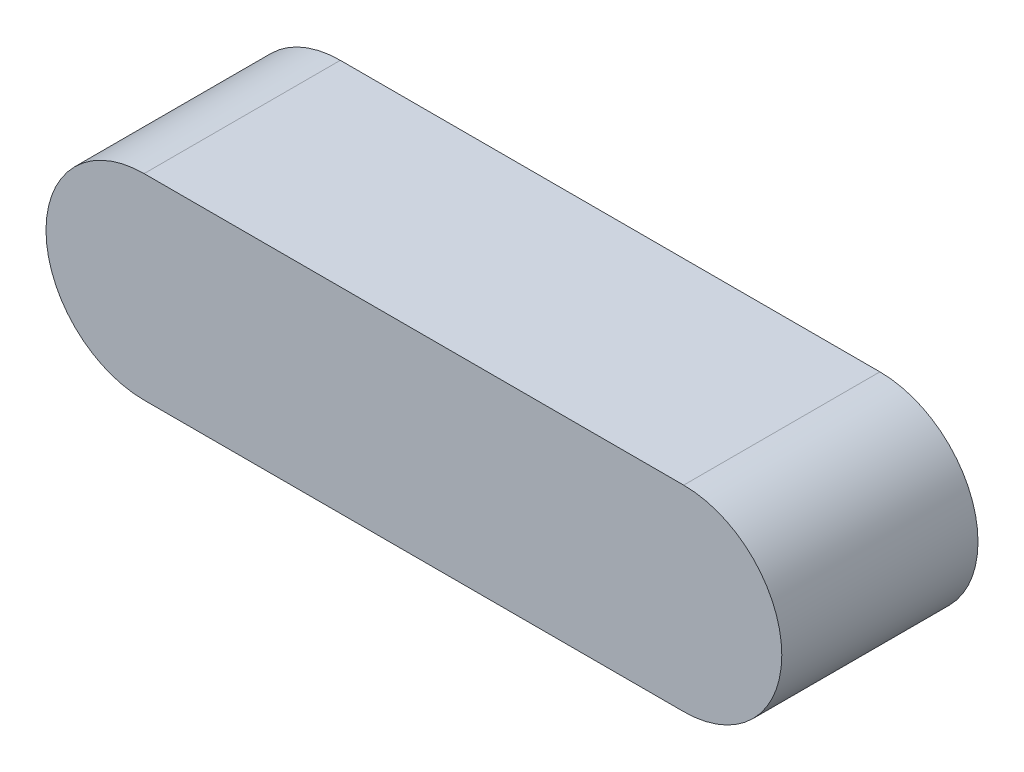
from build123d import *

# Parameters (mm, degrees)
BASE_EXTRUSION_DEPTH = 4


with BuildPart() as part:
    # Esquisse1 → Base-Extrusion (new body)
    with BuildSketch(Plane.XY):
        with BuildLine():
            Line((0, 2), (11, 2))
            ThreePointArc((11, 2), (13, 0), (11, -2))
            Line((11, -2), (0, -2))
            ThreePointArc((0, -2), (-2, 0), (0, 2))
        make_face()
    extrude(amount=BASE_EXTRUSION_DEPTH)


solid = part.part
